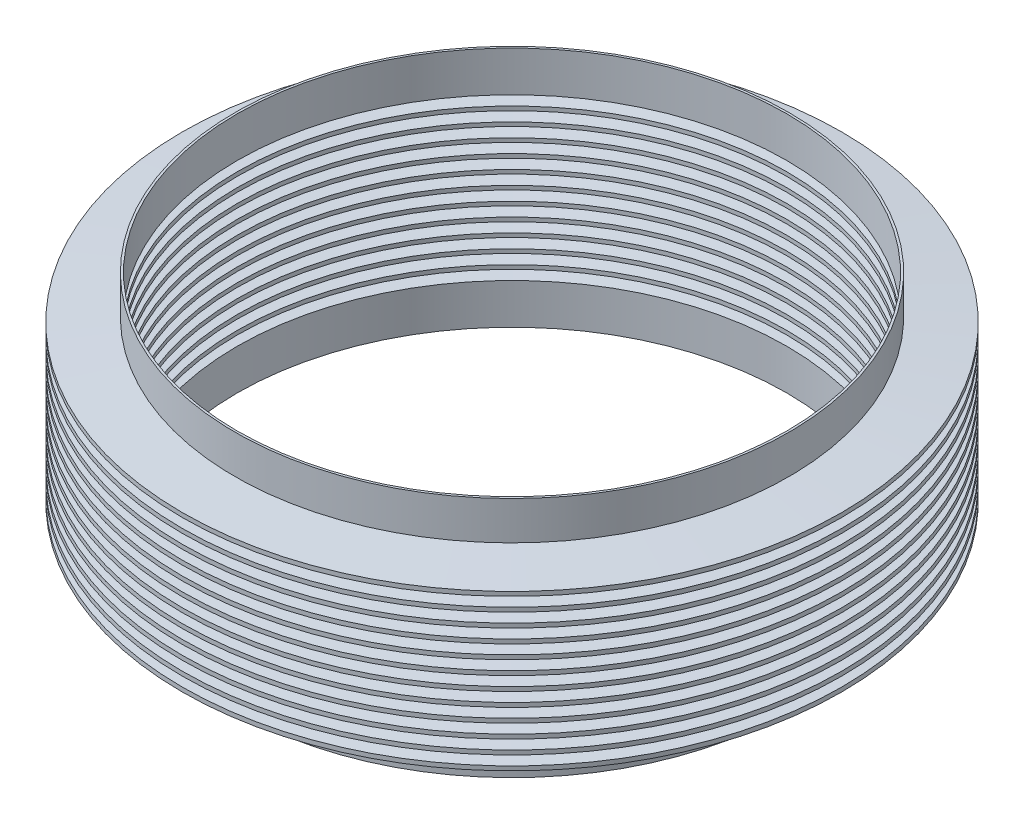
from build123d import *


with BuildPart() as part:
    # Sketch1 → Revolve1 (revolve)
    with BuildSketch(Plane.XY, mode=Mode.PRIVATE) as revolve1_sk:
        Polygon((-128.016, 0), (-127, 0), (-127, 18.709052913), (-152.071320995, 20.955), (-127, 23.200947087), (-127, 25.059052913), (-152.071320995, 27.305), (-127, 29.550947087), (-127, 31.409052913), (-152.071320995, 33.655), (-127, 35.900947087), (-127, 37.759052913), (-152.071320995, 40.005), (-127, 42.250947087), (-127, 44.109052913), (-152.071320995, 46.355), (-127, 48.600947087), (-127, 50.459052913), (-152.071320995, 52.705), (-127, 54.950947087), (-127, 56.809052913), (-152.071320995, 59.055), (-127, 61.300947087), (-127, 63.159052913), (-152.071320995, 65.405), (-127, 67.650947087), (-127, 69.509052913), (-152.071320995, 71.755), (-127, 74.000947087), (-127, 75.859052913), (-152.071320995, 78.105), (-127, 80.350947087), (-127, 82.209052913), (-152.071320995, 84.455), (-127, 86.700947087), (-127, 88.559052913), (-152.071320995, 90.805), (-127, 93.050947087), (-127, 111.76), (-128.016, 111.76), (-128.016, 93.98), (-152.4, 91.795624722), (-152.4, 89.814375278), (-128.016, 87.63), (-152.4, 85.445624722), (-152.4, 83.464375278), (-128.016, 81.28), (-152.4, 79.095624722), (-152.4, 77.114375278), (-128.016, 74.93), (-152.4, 72.745624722), (-152.4, 70.764375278), (-128.016, 68.58), (-152.4, 66.395624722), (-152.4, 64.414375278), (-128.016, 62.23), (-152.4, 60.045624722), (-152.4, 58.064375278), (-128.016, 55.88), (-152.4, 53.695624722), (-152.4, 51.714375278), (-128.016, 49.53), (-152.4, 47.345624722), (-152.4, 45.364375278), (-128.016, 43.18), (-152.4, 40.995624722), (-152.4, 39.014375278), (-128.016, 36.83), (-152.4, 34.645624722), (-152.4, 32.664375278), (-128.016, 30.48), (-152.4, 28.295624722), (-152.4, 26.314375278), (-128.016, 24.13), (-152.4, 21.945624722), (-152.4, 19.964375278), (-128.016, 17.78), align=None)
    revolve(revolve1_sk.sketch.rotate(Axis((0, 0, 0), (0, 1, 0)), 270), axis=Axis((0, 0, 0), (0, 1, 0)))


solid = part.part
